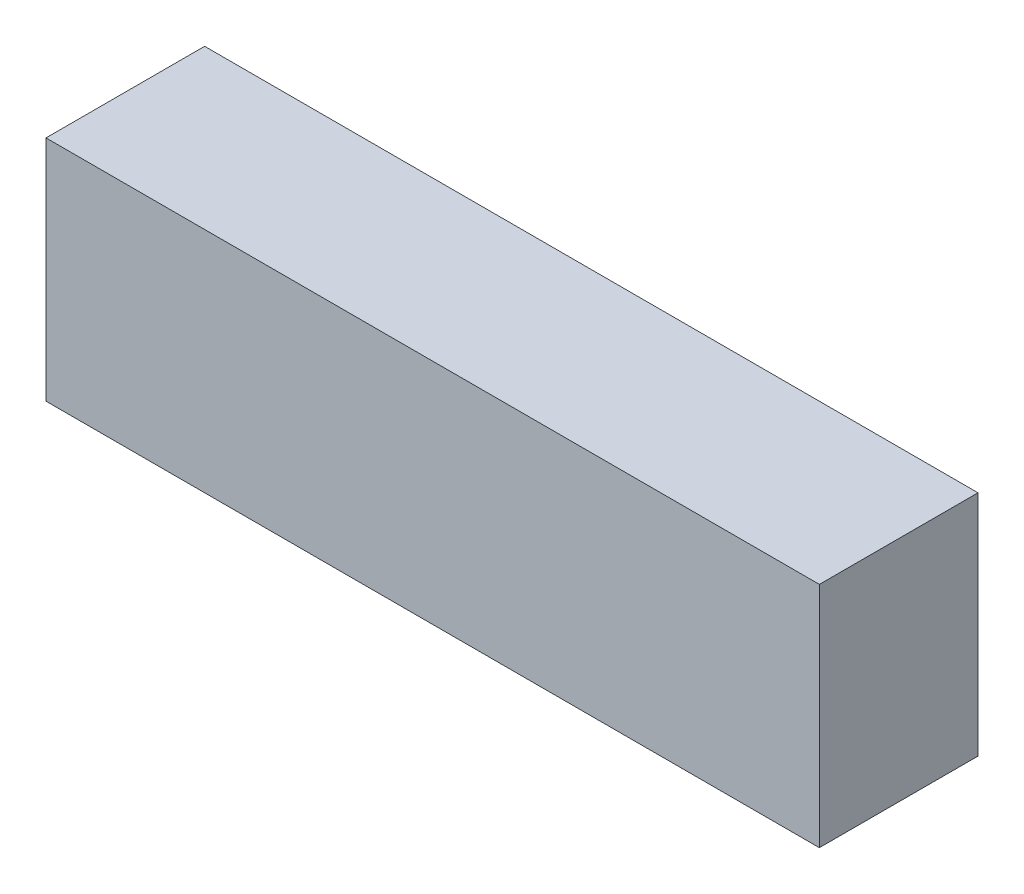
from build123d import *

# Parameters (mm, degrees)
ESBO_O1_W       = 156
ESBO_O1_H       = 32
EXTRUS_O1_DEPTH = 46


with BuildPart() as part:
    # Esbo_o1 → Extrus_o1 (new body)
    with BuildSketch(Plane(origin=(0, 0, 0), x_dir=(1, 0, 0), z_dir=(0, 1, 0))):
        Rectangle(ESBO_O1_W, ESBO_O1_H)
    extrude(amount=EXTRUS_O1_DEPTH)


solid = part.part
